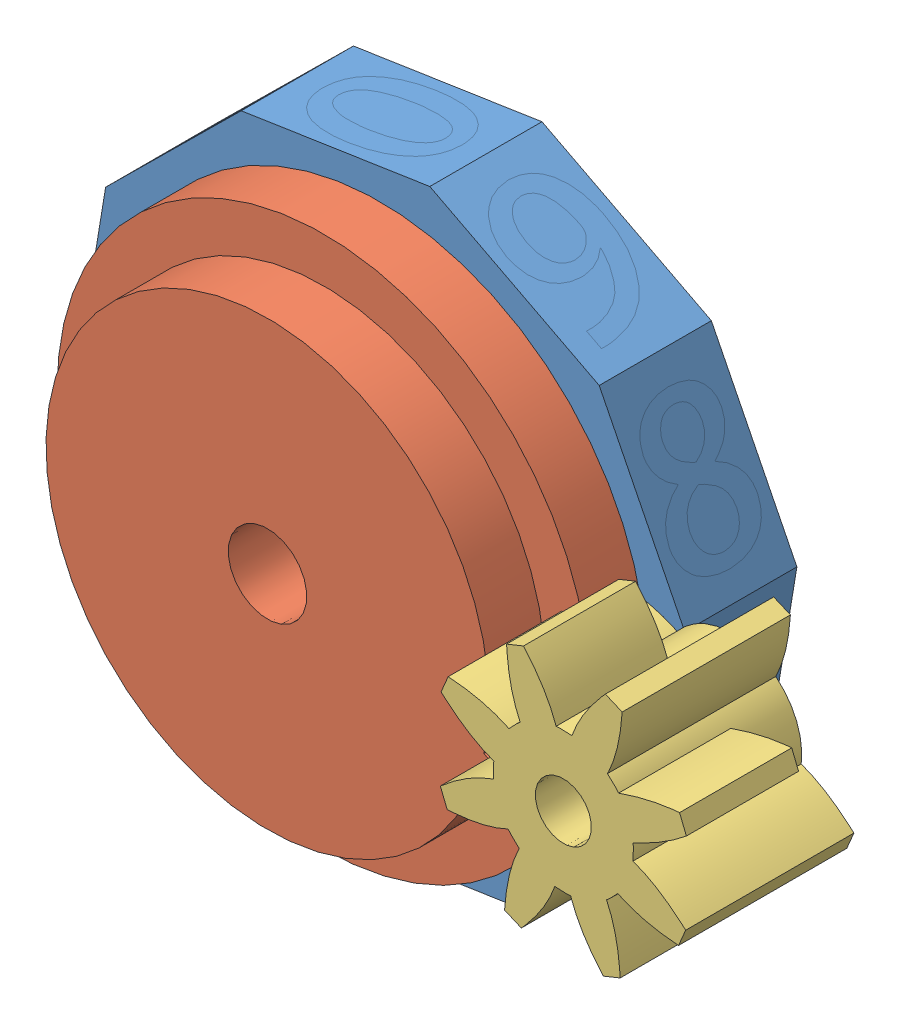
SolidWorks assembly 組合件4.SLDASM, configuration 預設 (file format 15000). Lengths in mm.
Overall size (175.18 164.4 50.25).
4 component instances, 3 part files, 4 mates.
Components (placement in the parent):
- 組合件1-1: 組合件1.SLDASM [預設] at (2.3615 -15.5239 -17.8216) x (0.988627 0.15039 0) z (0 0 1) size (150.53 149.34 40)
  - 零件5-1: 零件5.SLDPRT [預設] at (0 15.7025 27.8216) x (0.587785 0.809017 0) z (0 0 1) size (104.65 110.03 20)
  - 零件3-1: 零件3.SLDPRT [預設] at (0 15.7025 47.8216) x (-0.309017 -0.951057 0) z (0 0 1) size (95 94.72 20)
- 零件4-1: 零件4.SLDPRT [預設] at (121.4145 23.5954 20.25) x (0.374529 -0.927215 0) z (0 0 -1) size (46 46 30)
Mates (geometry in assembly coordinates):
- 同軸心1: concentric anti-aligned: cylinder of 組合件1-1/零件3-1 through (0 0 40) axis (0 0 -1) radius 7
- 重合/共線/共點1: coincident anti-aligned: plane of 組合件1-1/零件5-1 through (0 0 0) normal (0 0 -1)
- 同軸心2: concentric anti-aligned: cylinder of 零件4-1 through (63 0 85.6053) axis (0 0 -1) radius 5
- 平行相距1: distance = 0.25 mm anti-aligned: plane of 組合件1-1/零件3-1 through (51.0496 -20.719 30) normal (0 0 1); plane of 零件4-1 through (66.8565 -4.6804 30.25) normal (0 0 -1)
